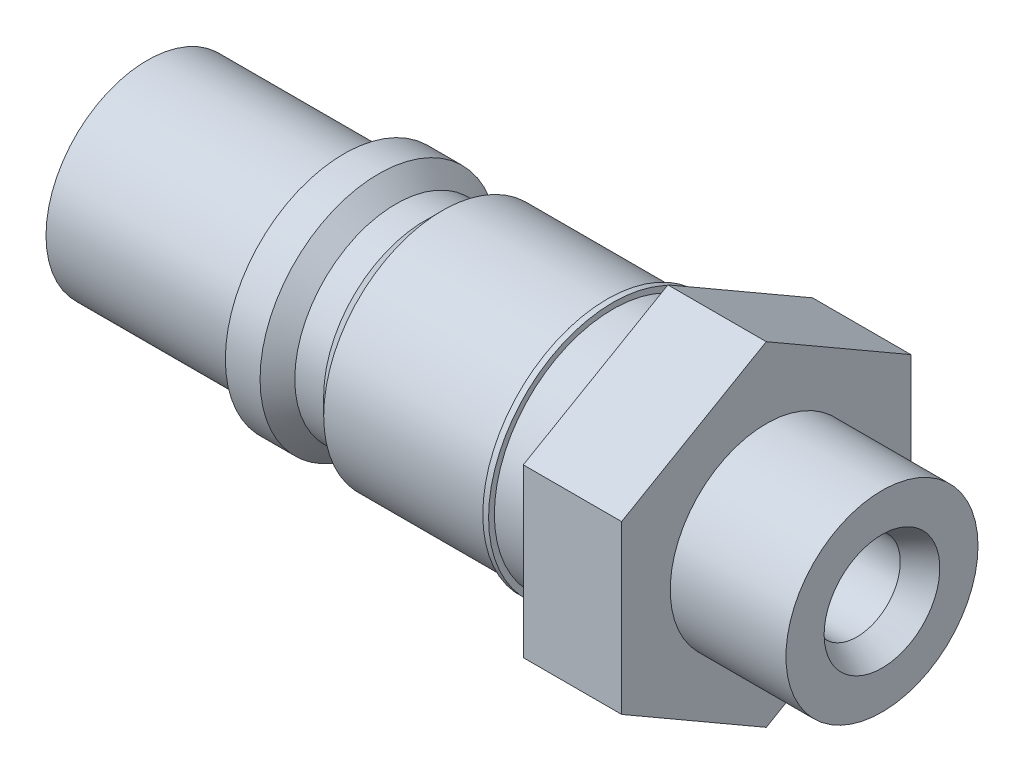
ISO-10303-21;
HEADER;
FILE_DESCRIPTION(('STEP AP214'),'2;1');
FILE_NAME('part.step','',(''),(''),'','','');
FILE_SCHEMA(('AUTOMOTIVE_DESIGN { 1 0 10303 214 1 1 1 1 }'));
ENDSEC;
DATA;
#1=APPLICATION_CONTEXT('core data for automotive mechanical design processes');
#2=APPLICATION_PROTOCOL_DEFINITION('international standard','automotive_design',2000,#1);
#3=PRODUCT_CONTEXT('',#1,'mechanical');
#4=PRODUCT('Part','Part','',(#3));
#5=PRODUCT_RELATED_PRODUCT_CATEGORY('part','',(#4));
#6=PRODUCT_DEFINITION_FORMATION('','',#4);
#7=PRODUCT_DEFINITION_CONTEXT('part definition',#1,'design');
#8=PRODUCT_DEFINITION('design','',#6,#7);
#9=PRODUCT_DEFINITION_SHAPE('','',#8);
#10=(LENGTH_UNIT() NAMED_UNIT(*) SI_UNIT(.MILLI.,.METRE.));
#11=(NAMED_UNIT(*) PLANE_ANGLE_UNIT() SI_UNIT($,.RADIAN.));
#12=(NAMED_UNIT(*) SI_UNIT($,.STERADIAN.) SOLID_ANGLE_UNIT());
#13=UNCERTAINTY_MEASURE_WITH_UNIT(LENGTH_MEASURE(1.E-05),#10,'distance_accuracy_value','');
#14=(GEOMETRIC_REPRESENTATION_CONTEXT(3) GLOBAL_UNCERTAINTY_ASSIGNED_CONTEXT((#13)) GLOBAL_UNIT_ASSIGNED_CONTEXT((#10,
#11,#12)) REPRESENTATION_CONTEXT('',''));
#15=CARTESIAN_POINT('',(0.,0.,0.));
#16=DIRECTION('',(0.,0.,1.));
#17=DIRECTION('',(1.,0.,0.));
#18=AXIS2_PLACEMENT_3D('',#15,#16,#17);
#19=CARTESIAN_POINT('',(0.,0.,0.));
#20=DIRECTION('',(1.,0.,0.));
#21=DIRECTION('',(0.,0.,-1.));
#22=AXIS2_PLACEMENT_3D('',#19,#20,#21);
#23=PLANE('',#22);
#24=CARTESIAN_POINT('',(0.,0.,0.));
#25=DIRECTION('',(-1.,0.,0.));
#26=DIRECTION('',(0.,0.,1.));
#27=AXIS2_PLACEMENT_3D('',#24,#25,#26);
#28=CIRCLE('',#27,7.5);
#29=CARTESIAN_POINT('',(0.,0.,7.5));
#30=VERTEX_POINT('',#29);
#31=EDGE_CURVE('E273',#30,#30,#28,.T.);
#32=ORIENTED_EDGE('',*,*,#31,.F.);
#33=EDGE_LOOP('',(#32));
#34=FACE_BOUND('',#33,.T.);
#35=CARTESIAN_POINT('',(0.,0.,0.));
#36=DIRECTION('',(-1.,0.,0.));
#37=DIRECTION('',(0.,0.,1.));
#38=AXIS2_PLACEMENT_3D('',#35,#36,#37);
#39=CIRCLE('',#38,17.5);
#40=CARTESIAN_POINT('',(0.,0.,17.5));
#41=VERTEX_POINT('',#40);
#42=EDGE_CURVE('E36',#41,#41,#39,.T.);
#43=ORIENTED_EDGE('',*,*,#42,.T.);
#44=EDGE_LOOP('',(#43));
#45=FACE_BOUND('',#44,.T.);
#46=ADVANCED_FACE('F33',(#34,#45),#23,.F.);
#47=CARTESIAN_POINT('',(0.,0.,0.));
#48=DIRECTION('',(-1.,0.,0.));
#49=DIRECTION('',(0.,0.,1.));
#50=AXIS2_PLACEMENT_3D('',#47,#48,#49);
#51=CYLINDRICAL_SURFACE('',#50,17.5);
#52=ORIENTED_EDGE('',*,*,#42,.F.);
#53=EDGE_LOOP('',(#52));
#54=FACE_BOUND('',#53,.T.);
#55=CARTESIAN_POINT('',(34.,0.,0.));
#56=DIRECTION('',(-1.,0.,0.));
#57=DIRECTION('',(0.,0.,1.));
#58=AXIS2_PLACEMENT_3D('',#55,#56,#57);
#59=CIRCLE('',#58,17.5);
#60=CARTESIAN_POINT('',(34.,0.,17.5));
#61=VERTEX_POINT('',#60);
#62=EDGE_CURVE('E168',#61,#61,#59,.T.);
#63=ORIENTED_EDGE('',*,*,#62,.T.);
#64=EDGE_LOOP('',(#63));
#65=FACE_BOUND('',#64,.T.);
#66=ADVANCED_FACE('F176',(#54,#65),#51,.T.);
#67=CARTESIAN_POINT('',(34.,17.5,0.));
#68=DIRECTION('',(1.,0.,0.));
#69=DIRECTION('',(0.,0.,-1.));
#70=AXIS2_PLACEMENT_3D('',#67,#68,#69);
#71=PLANE('',#70);
#72=ORIENTED_EDGE('',*,*,#62,.F.);
#73=EDGE_LOOP('',(#72));
#74=FACE_BOUND('',#73,.T.);
#75=CARTESIAN_POINT('',(34.,0.,0.));
#76=DIRECTION('',(-1.,0.,0.));
#77=DIRECTION('',(0.,0.,1.));
#78=AXIS2_PLACEMENT_3D('',#75,#76,#77);
#79=CIRCLE('',#78,20.5);
#80=CARTESIAN_POINT('',(34.,0.,20.5));
#81=VERTEX_POINT('',#80);
#82=EDGE_CURVE('E166',#81,#81,#79,.T.);
#83=ORIENTED_EDGE('',*,*,#82,.T.);
#84=EDGE_LOOP('',(#83));
#85=FACE_BOUND('',#84,.T.);
#86=ADVANCED_FACE('F178',(#74,#85),#71,.F.);
#87=CARTESIAN_POINT('',(0.,0.,0.));
#88=DIRECTION('',(-1.,0.,0.));
#89=DIRECTION('',(0.,0.,1.));
#90=AXIS2_PLACEMENT_3D('',#87,#88,#89);
#91=CYLINDRICAL_SURFACE('',#90,20.5);
#92=ORIENTED_EDGE('',*,*,#82,.F.);
#93=EDGE_LOOP('',(#92));
#94=FACE_BOUND('',#93,.T.);
#95=CARTESIAN_POINT('',(40.,0.,0.));
#96=DIRECTION('',(-1.,0.,0.));
#97=DIRECTION('',(0.,0.,1.));
#98=AXIS2_PLACEMENT_3D('',#95,#96,#97);
#99=CIRCLE('',#98,20.5);
#100=CARTESIAN_POINT('',(40.,0.,20.5));
#101=VERTEX_POINT('',#100);
#102=EDGE_CURVE('E163',#101,#101,#99,.T.);
#103=ORIENTED_EDGE('',*,*,#102,.T.);
#104=EDGE_LOOP('',(#103));
#105=FACE_BOUND('',#104,.T.);
#106=ADVANCED_FACE('F183',(#94,#105),#91,.T.);
#107=CARTESIAN_POINT('',(43.,0.,0.));
#108=DIRECTION('',(-1.,0.,0.));
#109=DIRECTION('',(0.,0.,1.));
#110=AXIS2_PLACEMENT_3D('',#107,#108,#109);
#111=CONICAL_SURFACE('',#110,17.5,0.78539816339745);
#112=ORIENTED_EDGE('',*,*,#102,.F.);
#113=EDGE_LOOP('',(#112));
#114=FACE_BOUND('',#113,.T.);
#115=CARTESIAN_POINT('',(43.,0.,0.));
#116=DIRECTION('',(-1.,0.,0.));
#117=DIRECTION('',(0.,0.,1.));
#118=AXIS2_PLACEMENT_3D('',#115,#116,#117);
#119=CIRCLE('',#118,17.5);
#120=CARTESIAN_POINT('',(43.,0.,17.5));
#121=VERTEX_POINT('',#120);
#122=EDGE_CURVE('E160',#121,#121,#119,.T.);
#123=ORIENTED_EDGE('',*,*,#122,.T.);
#124=EDGE_LOOP('',(#123));
#125=FACE_BOUND('',#124,.T.);
#126=ADVANCED_FACE('F190',(#114,#125),#111,.T.);
#127=CARTESIAN_POINT('',(0.,0.,0.));
#128=DIRECTION('',(-1.,0.,0.));
#129=DIRECTION('',(0.,0.,1.));
#130=AXIS2_PLACEMENT_3D('',#127,#128,#129);
#131=CYLINDRICAL_SURFACE('',#130,17.5);
#132=ORIENTED_EDGE('',*,*,#122,.F.);
#133=EDGE_LOOP('',(#132));
#134=FACE_BOUND('',#133,.T.);
#135=CARTESIAN_POINT('',(48.,0.,0.));
#136=DIRECTION('',(-1.,0.,0.));
#137=DIRECTION('',(0.,0.,1.));
#138=AXIS2_PLACEMENT_3D('',#135,#136,#137);
#139=CIRCLE('',#138,17.5);
#140=CARTESIAN_POINT('',(48.,0.,17.5));
#141=VERTEX_POINT('',#140);
#142=EDGE_CURVE('E157',#141,#141,#139,.T.);
#143=ORIENTED_EDGE('',*,*,#142,.T.);
#144=EDGE_LOOP('',(#143));
#145=FACE_BOUND('',#144,.T.);
#146=ADVANCED_FACE('F194',(#134,#145),#131,.T.);
#147=CARTESIAN_POINT('',(51.,0.,0.));
#148=DIRECTION('',(1.,0.,0.));
#149=DIRECTION('',(0.,0.,-1.));
#150=AXIS2_PLACEMENT_3D('',#147,#148,#149);
#151=CONICAL_SURFACE('',#150,20.5,0.785398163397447);
#152=ORIENTED_EDGE('',*,*,#142,.F.);
#153=EDGE_LOOP('',(#152));
#154=FACE_BOUND('',#153,.T.);
#155=CARTESIAN_POINT('',(51.,0.,0.));
#156=DIRECTION('',(-1.,0.,0.));
#157=DIRECTION('',(0.,0.,1.));
#158=AXIS2_PLACEMENT_3D('',#155,#156,#157);
#159=CIRCLE('',#158,20.5);
#160=CARTESIAN_POINT('',(51.,0.,20.5));
#161=VERTEX_POINT('',#160);
#162=EDGE_CURVE('E154',#161,#161,#159,.T.);
#163=ORIENTED_EDGE('',*,*,#162,.T.);
#164=EDGE_LOOP('',(#163));
#165=FACE_BOUND('',#164,.T.);
#166=ADVANCED_FACE('F198',(#154,#165),#151,.T.);
#167=CARTESIAN_POINT('',(0.,0.,0.));
#168=DIRECTION('',(-1.,0.,0.));
#169=DIRECTION('',(0.,0.,1.));
#170=AXIS2_PLACEMENT_3D('',#167,#168,#169);
#171=CYLINDRICAL_SURFACE('',#170,20.5);
#172=ORIENTED_EDGE('',*,*,#162,.F.);
#173=EDGE_LOOP('',(#172));
#174=FACE_BOUND('',#173,.T.);
#175=CARTESIAN_POINT('',(79.5,0.,0.));
#176=DIRECTION('',(-1.,0.,0.));
#177=DIRECTION('',(0.,0.,1.));
#178=AXIS2_PLACEMENT_3D('',#175,#176,#177);
#179=CIRCLE('',#178,20.5);
#180=CARTESIAN_POINT('',(79.5,0.,20.5));
#181=VERTEX_POINT('',#180);
#182=EDGE_CURVE('E151',#181,#181,#179,.T.);
#183=ORIENTED_EDGE('',*,*,#182,.T.);
#184=EDGE_LOOP('',(#183));
#185=FACE_BOUND('',#184,.T.);
#186=ADVANCED_FACE('F202',(#174,#185),#171,.T.);
#187=CARTESIAN_POINT('',(79.5,20.5,0.));
#188=DIRECTION('',(1.,0.,0.));
#189=DIRECTION('',(0.,0.,-1.));
#190=AXIS2_PLACEMENT_3D('',#187,#188,#189);
#191=PLANE('',#190);
#192=ORIENTED_EDGE('',*,*,#182,.F.);
#193=EDGE_LOOP('',(#192));
#194=FACE_BOUND('',#193,.T.);
#195=CARTESIAN_POINT('',(79.5,0.,0.));
#196=DIRECTION('',(-1.,0.,0.));
#197=DIRECTION('',(0.,0.,1.));
#198=AXIS2_PLACEMENT_3D('',#195,#196,#197);
#199=CIRCLE('',#198,21.5);
#200=CARTESIAN_POINT('',(79.5,0.,21.5));
#201=VERTEX_POINT('',#200);
#202=EDGE_CURVE('E148',#201,#201,#199,.T.);
#203=ORIENTED_EDGE('',*,*,#202,.T.);
#204=EDGE_LOOP('',(#203));
#205=FACE_BOUND('',#204,.T.);
#206=ADVANCED_FACE('F206',(#194,#205),#191,.F.);
#207=CARTESIAN_POINT('',(0.,0.,0.));
#208=DIRECTION('',(-1.,0.,0.));
#209=DIRECTION('',(0.,0.,1.));
#210=AXIS2_PLACEMENT_3D('',#207,#208,#209);
#211=CYLINDRICAL_SURFACE('',#210,21.5);
#212=ORIENTED_EDGE('',*,*,#202,.F.);
#213=EDGE_LOOP('',(#212));
#214=FACE_BOUND('',#213,.T.);
#215=CARTESIAN_POINT('',(80.5,0.,0.));
#216=DIRECTION('',(-1.,0.,0.));
#217=DIRECTION('',(0.,0.,1.));
#218=AXIS2_PLACEMENT_3D('',#215,#216,#217);
#219=CIRCLE('',#218,21.5);
#220=CARTESIAN_POINT('',(80.5,0.,21.5));
#221=VERTEX_POINT('',#220);
#222=EDGE_CURVE('E145',#221,#221,#219,.T.);
#223=ORIENTED_EDGE('',*,*,#222,.T.);
#224=EDGE_LOOP('',(#223));
#225=FACE_BOUND('',#224,.T.);
#226=ADVANCED_FACE('F210',(#214,#225),#211,.T.);
#227=CARTESIAN_POINT('',(80.5,21.5,0.));
#228=DIRECTION('',(-1.,0.,0.));
#229=DIRECTION('',(0.,0.,1.));
#230=AXIS2_PLACEMENT_3D('',#227,#228,#229);
#231=PLANE('',#230);
#232=ORIENTED_EDGE('',*,*,#222,.F.);
#233=EDGE_LOOP('',(#232));
#234=FACE_BOUND('',#233,.T.);
#235=CARTESIAN_POINT('',(80.5,0.,0.));
#236=DIRECTION('',(-1.,0.,0.));
#237=DIRECTION('',(0.,0.,1.));
#238=AXIS2_PLACEMENT_3D('',#235,#236,#237);
#239=CIRCLE('',#238,20.5);
#240=CARTESIAN_POINT('',(80.5,0.,20.5));
#241=VERTEX_POINT('',#240);
#242=EDGE_CURVE('E142',#241,#241,#239,.T.);
#243=ORIENTED_EDGE('',*,*,#242,.T.);
#244=EDGE_LOOP('',(#243));
#245=FACE_BOUND('',#244,.T.);
#246=ADVANCED_FACE('F214',(#234,#245),#231,.F.);
#247=CARTESIAN_POINT('',(0.,0.,0.));
#248=DIRECTION('',(-1.,0.,0.));
#249=DIRECTION('',(0.,0.,1.));
#250=AXIS2_PLACEMENT_3D('',#247,#248,#249);
#251=CYLINDRICAL_SURFACE('',#250,20.5);
#252=ORIENTED_EDGE('',*,*,#242,.F.);
#253=EDGE_LOOP('',(#252));
#254=FACE_BOUND('',#253,.T.);
#255=CARTESIAN_POINT('',(90.,0.,0.));
#256=DIRECTION('',(-1.,0.,0.));
#257=DIRECTION('',(0.,0.,1.));
#258=AXIS2_PLACEMENT_3D('',#255,#256,#257);
#259=CIRCLE('',#258,20.5);
#260=CARTESIAN_POINT('',(90.,0.,20.5));
#261=VERTEX_POINT('',#260);
#262=EDGE_CURVE('E139',#261,#261,#259,.T.);
#263=ORIENTED_EDGE('',*,*,#262,.T.);
#264=EDGE_LOOP('',(#263));
#265=FACE_BOUND('',#264,.T.);
#266=ADVANCED_FACE('F218',(#254,#265),#251,.T.);
#267=CARTESIAN_POINT('',(107.,14.4337567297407,-25.));
#268=DIRECTION('',(0.,-0.866025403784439,0.5));
#269=DIRECTION('',(0.,-0.5,-0.866025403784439));
#270=AXIS2_PLACEMENT_3D('',#267,#268,#269);
#271=PLANE('',#270);
#272=DIRECTION('',(0.,0.5,0.866025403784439));
#273=VECTOR('',#272,1.);
#274=CARTESIAN_POINT('',(90.,14.4337567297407,-25.));
#275=LINE('',#274,#273);
#276=CARTESIAN_POINT('',(90.,14.4337567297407,-25.));
#277=VERTEX_POINT('',#276);
#278=CARTESIAN_POINT('',(90.,28.8675134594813,0.));
#279=VERTEX_POINT('',#278);
#280=EDGE_CURVE('E119',#277,#279,#275,.T.);
#281=ORIENTED_EDGE('',*,*,#280,.T.);
#282=DIRECTION('',(-1.,0.,0.));
#283=VECTOR('',#282,1.);
#284=CARTESIAN_POINT('',(107.,28.8675134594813,0.));
#285=LINE('',#284,#283);
#286=CARTESIAN_POINT('',(107.,28.8675134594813,0.));
#287=VERTEX_POINT('',#286);
#288=EDGE_CURVE('E137',#287,#279,#285,.T.);
#289=ORIENTED_EDGE('',*,*,#288,.F.);
#290=DIRECTION('',(0.,0.5,0.866025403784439));
#291=VECTOR('',#290,1.);
#292=CARTESIAN_POINT('',(107.,14.4337567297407,-25.));
#293=LINE('',#292,#291);
#294=CARTESIAN_POINT('',(107.,14.4337567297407,-25.));
#295=VERTEX_POINT('',#294);
#296=EDGE_CURVE('E130',#295,#287,#293,.T.);
#297=ORIENTED_EDGE('',*,*,#296,.F.);
#298=DIRECTION('',(-1.,0.,0.));
#299=VECTOR('',#298,1.);
#300=CARTESIAN_POINT('',(107.,14.4337567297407,-25.));
#301=LINE('',#300,#299);
#302=EDGE_CURVE('E115',#295,#277,#301,.T.);
#303=ORIENTED_EDGE('',*,*,#302,.T.);
#304=EDGE_LOOP('',(#281,#289,#297,#303));
#305=FACE_BOUND('',#304,.T.);
#306=ADVANCED_FACE('F222',(#305),#271,.F.);
#307=CARTESIAN_POINT('',(107.,28.8675134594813,0.));
#308=DIRECTION('',(0.,-0.866025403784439,-0.5));
#309=DIRECTION('',(0.,0.5,-0.866025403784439));
#310=AXIS2_PLACEMENT_3D('',#307,#308,#309);
#311=PLANE('',#310);
#312=DIRECTION('',(0.,-0.5,0.866025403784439));
#313=VECTOR('',#312,1.);
#314=CARTESIAN_POINT('',(90.,28.8675134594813,0.));
#315=LINE('',#314,#313);
#316=CARTESIAN_POINT('',(90.,14.4337567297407,25.));
#317=VERTEX_POINT('',#316);
#318=EDGE_CURVE('E122',#279,#317,#315,.T.);
#319=ORIENTED_EDGE('',*,*,#318,.T.);
#320=DIRECTION('',(-1.,0.,0.));
#321=VECTOR('',#320,1.);
#322=CARTESIAN_POINT('',(107.,14.4337567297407,25.));
#323=LINE('',#322,#321);
#324=CARTESIAN_POINT('',(107.,14.4337567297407,25.));
#325=VERTEX_POINT('',#324);
#326=EDGE_CURVE('E134',#325,#317,#323,.T.);
#327=ORIENTED_EDGE('',*,*,#326,.F.);
#328=DIRECTION('',(0.,-0.5,0.866025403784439));
#329=VECTOR('',#328,1.);
#330=CARTESIAN_POINT('',(107.,28.8675134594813,0.));
#331=LINE('',#330,#329);
#332=EDGE_CURVE('E88',#287,#325,#331,.T.);
#333=ORIENTED_EDGE('',*,*,#332,.F.);
#334=ORIENTED_EDGE('',*,*,#288,.T.);
#335=EDGE_LOOP('',(#319,#327,#333,#334));
#336=FACE_BOUND('',#335,.T.);
#337=ADVANCED_FACE('F226',(#336),#311,.F.);
#338=CARTESIAN_POINT('',(107.,14.4337567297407,25.));
#339=DIRECTION('',(0.,0.,-1.));
#340=DIRECTION('',(-1.,0.,0.));
#341=AXIS2_PLACEMENT_3D('',#338,#339,#340);
#342=PLANE('',#341);
#343=DIRECTION('',(0.,-1.,0.));
#344=VECTOR('',#343,1.);
#345=CARTESIAN_POINT('',(90.,14.4337567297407,25.));
#346=LINE('',#345,#344);
#347=CARTESIAN_POINT('',(90.,-14.4337567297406,25.));
#348=VERTEX_POINT('',#347);
#349=EDGE_CURVE('E125',#317,#348,#346,.T.);
#350=ORIENTED_EDGE('',*,*,#349,.T.);
#351=DIRECTION('',(-1.,0.,0.));
#352=VECTOR('',#351,1.);
#353=CARTESIAN_POINT('',(107.,-14.4337567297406,25.));
#354=LINE('',#353,#352);
#355=CARTESIAN_POINT('',(107.,-14.4337567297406,25.));
#356=VERTEX_POINT('',#355);
#357=EDGE_CURVE('E110',#356,#348,#354,.T.);
#358=ORIENTED_EDGE('',*,*,#357,.F.);
#359=DIRECTION('',(0.,-1.,0.));
#360=VECTOR('',#359,1.);
#361=CARTESIAN_POINT('',(107.,14.4337567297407,25.));
#362=LINE('',#361,#360);
#363=EDGE_CURVE('E101',#325,#356,#362,.T.);
#364=ORIENTED_EDGE('',*,*,#363,.F.);
#365=ORIENTED_EDGE('',*,*,#326,.T.);
#366=EDGE_LOOP('',(#350,#358,#364,#365));
#367=FACE_BOUND('',#366,.T.);
#368=ADVANCED_FACE('F230',(#367),#342,.F.);
#369=CARTESIAN_POINT('',(107.,-14.4337567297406,25.));
#370=DIRECTION('',(0.,0.866025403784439,-0.5));
#371=DIRECTION('',(0.,0.5,0.866025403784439));
#372=AXIS2_PLACEMENT_3D('',#369,#370,#371);
#373=PLANE('',#372);
#374=DIRECTION('',(0.,-0.5,-0.866025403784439));
#375=VECTOR('',#374,1.);
#376=CARTESIAN_POINT('',(90.,-14.4337567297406,25.));
#377=LINE('',#376,#375);
#378=CARTESIAN_POINT('',(90.,-28.8675134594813,0.));
#379=VERTEX_POINT('',#378);
#380=EDGE_CURVE('E109',#348,#379,#377,.T.);
#381=ORIENTED_EDGE('',*,*,#380,.T.);
#382=DIRECTION('',(-1.,0.,0.));
#383=VECTOR('',#382,1.);
#384=CARTESIAN_POINT('',(107.,-28.8675134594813,0.));
#385=LINE('',#384,#383);
#386=CARTESIAN_POINT('',(107.,-28.8675134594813,0.));
#387=VERTEX_POINT('',#386);
#388=EDGE_CURVE('E106',#387,#379,#385,.T.);
#389=ORIENTED_EDGE('',*,*,#388,.F.);
#390=DIRECTION('',(0.,-0.5,-0.866025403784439));
#391=VECTOR('',#390,1.);
#392=CARTESIAN_POINT('',(107.,-14.4337567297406,25.));
#393=LINE('',#392,#391);
#394=EDGE_CURVE('E95',#356,#387,#393,.T.);
#395=ORIENTED_EDGE('',*,*,#394,.F.);
#396=ORIENTED_EDGE('',*,*,#357,.T.);
#397=EDGE_LOOP('',(#381,#389,#395,#396));
#398=FACE_BOUND('',#397,.T.);
#399=ADVANCED_FACE('F107',(#398),#373,.F.);
#400=CARTESIAN_POINT('',(107.,-28.8675134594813,0.));
#401=DIRECTION('',(0.,0.866025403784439,0.5));
#402=DIRECTION('',(0.,-0.5,0.866025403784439));
#403=AXIS2_PLACEMENT_3D('',#400,#401,#402);
#404=PLANE('',#403);
#405=DIRECTION('',(0.,0.5,-0.866025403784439));
#406=VECTOR('',#405,1.);
#407=CARTESIAN_POINT('',(90.,-28.8675134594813,0.));
#408=LINE('',#407,#406);
#409=CARTESIAN_POINT('',(90.,-14.4337567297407,-25.));
#410=VERTEX_POINT('',#409);
#411=EDGE_CURVE('E73',#379,#410,#408,.T.);
#412=ORIENTED_EDGE('',*,*,#411,.T.);
#413=DIRECTION('',(-1.,0.,0.));
#414=VECTOR('',#413,1.);
#415=CARTESIAN_POINT('',(107.,-14.4337567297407,-25.));
#416=LINE('',#415,#414);
#417=CARTESIAN_POINT('',(107.,-14.4337567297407,-25.));
#418=VERTEX_POINT('',#417);
#419=EDGE_CURVE('E111',#418,#410,#416,.T.);
#420=ORIENTED_EDGE('',*,*,#419,.F.);
#421=DIRECTION('',(0.,0.5,-0.866025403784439));
#422=VECTOR('',#421,1.);
#423=CARTESIAN_POINT('',(107.,-28.8675134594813,0.));
#424=LINE('',#423,#422);
#425=EDGE_CURVE('E99',#387,#418,#424,.T.);
#426=ORIENTED_EDGE('',*,*,#425,.F.);
#427=ORIENTED_EDGE('',*,*,#388,.T.);
#428=EDGE_LOOP('',(#412,#420,#426,#427));
#429=FACE_BOUND('',#428,.T.);
#430=ADVANCED_FACE('F113',(#429),#404,.F.);
#431=CARTESIAN_POINT('',(107.,-14.4337567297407,-25.));
#432=DIRECTION('',(0.,0.,1.));
#433=DIRECTION('',(0.,-1.,0.));
#434=AXIS2_PLACEMENT_3D('',#431,#432,#433);
#435=PLANE('',#434);
#436=DIRECTION('',(0.,1.,0.));
#437=VECTOR('',#436,1.);
#438=CARTESIAN_POINT('',(90.,-14.4337567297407,-25.));
#439=LINE('',#438,#437);
#440=EDGE_CURVE('E79',#410,#277,#439,.T.);
#441=ORIENTED_EDGE('',*,*,#440,.T.);
#442=ORIENTED_EDGE('',*,*,#302,.F.);
#443=DIRECTION('',(0.,1.,0.));
#444=VECTOR('',#443,1.);
#445=CARTESIAN_POINT('',(107.,-14.4337567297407,-25.));
#446=LINE('',#445,#444);
#447=EDGE_CURVE('E50',#418,#295,#446,.T.);
#448=ORIENTED_EDGE('',*,*,#447,.F.);
#449=ORIENTED_EDGE('',*,*,#419,.T.);
#450=EDGE_LOOP('',(#441,#442,#448,#449));
#451=FACE_BOUND('',#450,.T.);
#452=ADVANCED_FACE('F238',(#451),#435,.F.);
#453=CARTESIAN_POINT('',(107.,0.,0.));
#454=DIRECTION('',(1.,0.,0.));
#455=DIRECTION('',(0.,0.,-1.));
#456=AXIS2_PLACEMENT_3D('',#453,#454,#455);
#457=PLANE('',#456);
#458=CARTESIAN_POINT('',(107.,0.,0.));
#459=DIRECTION('',(1.,0.,0.));
#460=DIRECTION('',(0.,0.,-1.));
#461=AXIS2_PLACEMENT_3D('',#458,#459,#460);
#462=CIRCLE('',#461,16.6);
#463=CARTESIAN_POINT('',(107.,0.,-16.6));
#464=VERTEX_POINT('',#463);
#465=EDGE_CURVE('E11',#464,#464,#462,.T.);
#466=ORIENTED_EDGE('',*,*,#465,.F.);
#467=EDGE_LOOP('',(#466));
#468=FACE_BOUND('',#467,.T.);
#469=ORIENTED_EDGE('',*,*,#296,.T.);
#470=ORIENTED_EDGE('',*,*,#332,.T.);
#471=ORIENTED_EDGE('',*,*,#363,.T.);
#472=ORIENTED_EDGE('',*,*,#394,.T.);
#473=ORIENTED_EDGE('',*,*,#425,.T.);
#474=ORIENTED_EDGE('',*,*,#447,.T.);
#475=EDGE_LOOP('',(#469,#470,#471,#472,#473,#474));
#476=FACE_BOUND('',#475,.T.);
#477=ADVANCED_FACE('F97',(#468,#476),#457,.T.);
#478=CARTESIAN_POINT('',(90.,0.,0.));
#479=DIRECTION('',(1.,0.,0.));
#480=DIRECTION('',(0.,0.,-1.));
#481=AXIS2_PLACEMENT_3D('',#478,#479,#480);
#482=PLANE('',#481);
#483=ORIENTED_EDGE('',*,*,#262,.F.);
#484=EDGE_LOOP('',(#483));
#485=FACE_BOUND('',#484,.T.);
#486=ORIENTED_EDGE('',*,*,#280,.F.);
#487=ORIENTED_EDGE('',*,*,#440,.F.);
#488=ORIENTED_EDGE('',*,*,#411,.F.);
#489=ORIENTED_EDGE('',*,*,#380,.F.);
#490=ORIENTED_EDGE('',*,*,#349,.F.);
#491=ORIENTED_EDGE('',*,*,#318,.F.);
#492=EDGE_LOOP('',(#486,#487,#488,#489,#490,#491));
#493=FACE_BOUND('',#492,.T.);
#494=ADVANCED_FACE('F241',(#485,#493),#482,.F.);
#495=CARTESIAN_POINT('',(127.,0.,0.));
#496=DIRECTION('',(-1.,0.,0.));
#497=DIRECTION('',(0.,0.,1.));
#498=AXIS2_PLACEMENT_3D('',#495,#496,#497);
#499=CYLINDRICAL_SURFACE('',#498,16.6);
#500=CARTESIAN_POINT('',(127.,0.,0.));
#501=DIRECTION('',(1.,0.,0.));
#502=DIRECTION('',(0.,0.,-1.));
#503=AXIS2_PLACEMENT_3D('',#500,#501,#502);
#504=CIRCLE('',#503,16.6);
#505=CARTESIAN_POINT('',(127.,0.,-16.6));
#506=VERTEX_POINT('',#505);
#507=EDGE_CURVE('E123',#506,#506,#504,.T.);
#508=ORIENTED_EDGE('',*,*,#507,.F.);
#509=EDGE_LOOP('',(#508));
#510=FACE_BOUND('',#509,.T.);
#511=ORIENTED_EDGE('',*,*,#465,.T.);
#512=EDGE_LOOP('',(#511));
#513=FACE_BOUND('',#512,.T.);
#514=ADVANCED_FACE('F244',(#510,#513),#499,.T.);
#515=CARTESIAN_POINT('',(127.,0.,0.));
#516=DIRECTION('',(1.,0.,0.));
#517=DIRECTION('',(0.,0.,-1.));
#518=AXIS2_PLACEMENT_3D('',#515,#516,#517);
#519=PLANE('',#518);
#520=CARTESIAN_POINT('',(127.,0.,0.));
#521=DIRECTION('',(-1.,0.,0.));
#522=DIRECTION('',(0.,0.,1.));
#523=AXIS2_PLACEMENT_3D('',#520,#521,#522);
#524=CIRCLE('',#523,10.);
#525=CARTESIAN_POINT('',(127.,0.,10.));
#526=VERTEX_POINT('',#525);
#527=EDGE_CURVE('E271',#526,#526,#524,.T.);
#528=ORIENTED_EDGE('',*,*,#527,.T.);
#529=EDGE_LOOP('',(#528));
#530=FACE_BOUND('',#529,.T.);
#531=ORIENTED_EDGE('',*,*,#507,.T.);
#532=EDGE_LOOP('',(#531));
#533=FACE_BOUND('',#532,.T.);
#534=ADVANCED_FACE('F251',(#530,#533),#519,.T.);
#535=CARTESIAN_POINT('',(0.,0.,0.));
#536=DIRECTION('',(-1.,0.,0.));
#537=DIRECTION('',(0.,0.,1.));
#538=AXIS2_PLACEMENT_3D('',#535,#536,#537);
#539=CYLINDRICAL_SURFACE('',#538,7.5);
#540=ORIENTED_EDGE('',*,*,#31,.T.);
#541=EDGE_LOOP('',(#540));
#542=FACE_BOUND('',#541,.T.);
#543=CARTESIAN_POINT('',(122.669872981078,0.,0.));
#544=DIRECTION('',(-1.,0.,0.));
#545=DIRECTION('',(0.,0.,1.));
#546=AXIS2_PLACEMENT_3D('',#543,#544,#545);
#547=CIRCLE('',#546,7.5);
#548=CARTESIAN_POINT('',(122.669872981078,0.,7.5));
#549=VERTEX_POINT('',#548);
#550=EDGE_CURVE('E268',#549,#549,#547,.T.);
#551=ORIENTED_EDGE('',*,*,#550,.F.);
#552=EDGE_LOOP('',(#551));
#553=FACE_BOUND('',#552,.T.);
#554=ADVANCED_FACE('F255',(#542,#553),#539,.F.);
#555=CARTESIAN_POINT('',(127.,0.,0.));
#556=DIRECTION('',(1.,0.,0.));
#557=DIRECTION('',(0.,0.,-1.));
#558=AXIS2_PLACEMENT_3D('',#555,#556,#557);
#559=CONICAL_SURFACE('',#558,10.,0.5235987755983);
#560=ORIENTED_EDGE('',*,*,#550,.T.);
#561=EDGE_LOOP('',(#560));
#562=FACE_BOUND('',#561,.T.);
#563=ORIENTED_EDGE('',*,*,#527,.F.);
#564=EDGE_LOOP('',(#563));
#565=FACE_BOUND('',#564,.T.);
#566=ADVANCED_FACE('F259',(#562,#565),#559,.F.);
#567=CLOSED_SHELL('',(#46,#66,#86,#106,#126,#146,#166,#186,#206,#226,#246,#266,#306,#337,#368,
#399,#430,#452,#477,#494,#514,#534,#554,#566));
#568=MANIFOLD_SOLID_BREP('B2',#567);
#569=ADVANCED_BREP_SHAPE_REPRESENTATION('',(#18,#568),#14);
#570=SHAPE_DEFINITION_REPRESENTATION(#9,#569);
ENDSEC;
END-ISO-10303-21;
